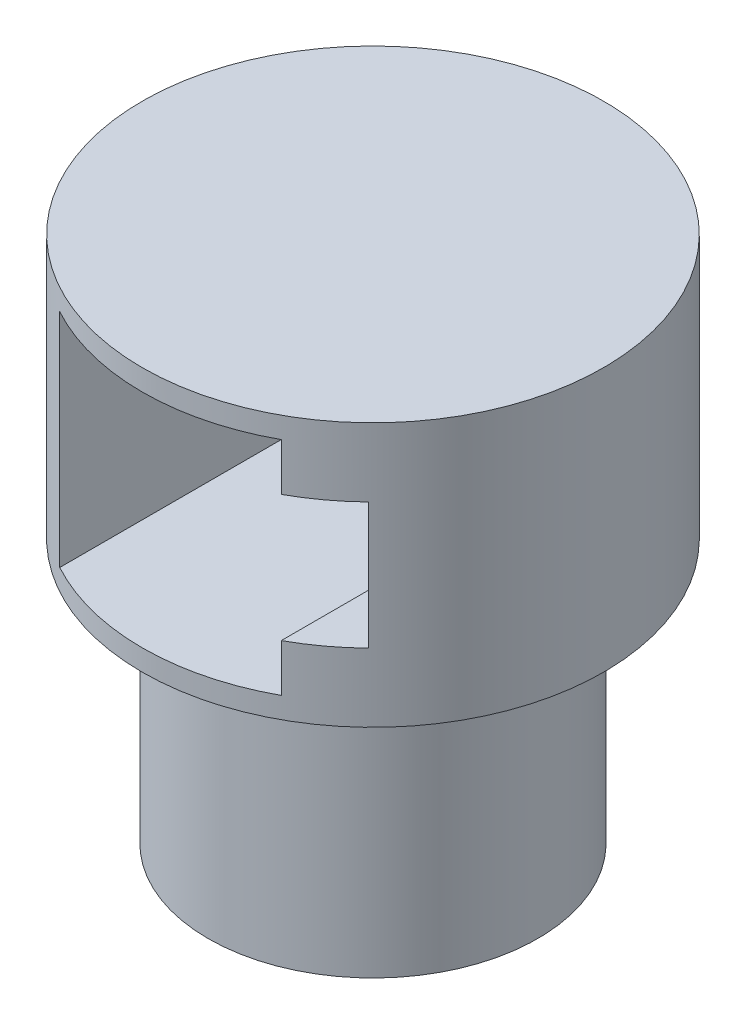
ISO-10303-21;
HEADER;
FILE_DESCRIPTION(('STEP AP214'),'2;1');
FILE_NAME('part.step','',(''),(''),'','','');
FILE_SCHEMA(('AUTOMOTIVE_DESIGN { 1 0 10303 214 1 1 1 1 }'));
ENDSEC;
DATA;
#1=APPLICATION_CONTEXT('core data for automotive mechanical design processes');
#2=APPLICATION_PROTOCOL_DEFINITION('international standard','automotive_design',2000,#1);
#3=PRODUCT_CONTEXT('',#1,'mechanical');
#4=PRODUCT('Part','Part','',(#3));
#5=PRODUCT_RELATED_PRODUCT_CATEGORY('part','',(#4));
#6=PRODUCT_DEFINITION_FORMATION('','',#4);
#7=PRODUCT_DEFINITION_CONTEXT('part definition',#1,'design');
#8=PRODUCT_DEFINITION('design','',#6,#7);
#9=PRODUCT_DEFINITION_SHAPE('','',#8);
#10=(LENGTH_UNIT() NAMED_UNIT(*) SI_UNIT(.MILLI.,.METRE.));
#11=(NAMED_UNIT(*) PLANE_ANGLE_UNIT() SI_UNIT($,.RADIAN.));
#12=(NAMED_UNIT(*) SI_UNIT($,.STERADIAN.) SOLID_ANGLE_UNIT());
#13=UNCERTAINTY_MEASURE_WITH_UNIT(LENGTH_MEASURE(1.E-05),#10,'distance_accuracy_value','');
#14=(GEOMETRIC_REPRESENTATION_CONTEXT(3) GLOBAL_UNCERTAINTY_ASSIGNED_CONTEXT((#13)) GLOBAL_UNIT_ASSIGNED_CONTEXT((#10,
#11,#12)) REPRESENTATION_CONTEXT('',''));
#15=CARTESIAN_POINT('',(0.,0.,0.));
#16=DIRECTION('',(0.,0.,1.));
#17=DIRECTION('',(1.,0.,0.));
#18=AXIS2_PLACEMENT_3D('',#15,#16,#17);
#19=CARTESIAN_POINT('',(0.,0.,0.));
#20=DIRECTION('',(0.,1.,0.));
#21=DIRECTION('',(0.,0.,1.));
#22=AXIS2_PLACEMENT_3D('',#19,#20,#21);
#23=PLANE('',#22);
#24=CARTESIAN_POINT('',(0.,0.,0.));
#25=DIRECTION('',(0.,1.,0.));
#26=DIRECTION('',(0.,0.,1.));
#27=AXIS2_PLACEMENT_3D('',#24,#25,#26);
#28=CIRCLE('',#27,31.75);
#29=CARTESIAN_POINT('',(0.,0.,31.75));
#30=VERTEX_POINT('',#29);
#31=EDGE_CURVE('E218',#30,#30,#28,.T.);
#32=ORIENTED_EDGE('',*,*,#31,.F.);
#33=EDGE_LOOP('',(#32));
#34=FACE_BOUND('',#33,.T.);
#35=CARTESIAN_POINT('',(0.,-1.20000000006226E-05,0.));
#36=DIRECTION('',(0.,-1.,0.));
#37=DIRECTION('',(0.699448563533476,0.,0.714682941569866));
#38=AXIS2_PLACEMENT_3D('',#35,#36,#37);
#39=CIRCLE('',#38,2.667);
#40=CARTESIAN_POINT('',(1.86543152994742,-1.2E-05,1.90606166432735));
#41=VERTEX_POINT('',#40);
#42=CARTESIAN_POINT('',(-1.8653831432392,-1.2E-05,1.90610202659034));
#43=VERTEX_POINT('',#42);
#44=EDGE_CURVE('E196',#41,#43,#39,.T.);
#45=ORIENTED_EDGE('',*,*,#44,.F.);
#46=CARTESIAN_POINT('',(0.,0.,0.));
#47=DIRECTION('',(0.,-1.,0.));
#48=DIRECTION('',(-0.699854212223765,0.,0.714285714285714));
#49=AXIS2_PLACEMENT_3D('',#46,#47,#48);
#50=CIRCLE('',#49,2.667);
#51=EDGE_CURVE('E206',#43,#41,#50,.T.);
#52=ORIENTED_EDGE('',*,*,#51,.F.);
#53=EDGE_LOOP('',(#45,#52));
#54=FACE_BOUND('',#53,.T.);
#55=ADVANCED_FACE('F50',(#34,#54),#23,.F.);
#56=CARTESIAN_POINT('',(0.,25.4,1.905));
#57=DIRECTION('',(0.,0.,-1.));
#58=DIRECTION('',(-1.,0.,0.));
#59=AXIS2_PLACEMENT_3D('',#56,#57,#58);
#60=PLANE('',#59);
#61=DIRECTION('',(0.,-1.,0.));
#62=VECTOR('',#61,1.);
#63=CARTESIAN_POINT('',(1.86651118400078,25.4,1.905));
#64=LINE('',#63,#62);
#65=CARTESIAN_POINT('',(1.86651118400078,25.4,1.905));
#66=VERTEX_POINT('',#65);
#67=CARTESIAN_POINT('',(1.86651118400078,5.588,1.905));
#68=VERTEX_POINT('',#67);
#69=EDGE_CURVE('E224',#66,#68,#64,.T.);
#70=ORIENTED_EDGE('',*,*,#69,.T.);
#71=DIRECTION('',(-1.,0.,0.));
#72=VECTOR('',#71,1.);
#73=CARTESIAN_POINT('',(0.,5.588,1.905));
#74=LINE('',#73,#72);
#75=CARTESIAN_POINT('',(-1.86651118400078,5.588,1.905));
#76=VERTEX_POINT('',#75);
#77=EDGE_CURVE('E198',#68,#76,#74,.T.);
#78=ORIENTED_EDGE('',*,*,#77,.T.);
#79=DIRECTION('',(0.,-1.,0.));
#80=VECTOR('',#79,1.);
#81=CARTESIAN_POINT('',(-1.86651118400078,25.4,1.905));
#82=LINE('',#81,#80);
#83=CARTESIAN_POINT('',(-1.86651118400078,25.4,1.905));
#84=VERTEX_POINT('',#83);
#85=EDGE_CURVE('E216',#84,#76,#82,.T.);
#86=ORIENTED_EDGE('',*,*,#85,.F.);
#87=DIRECTION('',(1.,0.,0.));
#88=VECTOR('',#87,1.);
#89=CARTESIAN_POINT('',(0.,25.4,1.905));
#90=LINE('',#89,#88);
#91=EDGE_CURVE('E215',#84,#66,#90,.T.);
#92=ORIENTED_EDGE('',*,*,#91,.T.);
#93=EDGE_LOOP('',(#70,#78,#86,#92));
#94=FACE_BOUND('',#93,.T.);
#95=ADVANCED_FACE('F252',(#94),#60,.T.);
#96=CARTESIAN_POINT('',(0.,101.6,0.));
#97=DIRECTION('',(0.,-1.,0.));
#98=DIRECTION('',(0.,0.,-1.));
#99=AXIS2_PLACEMENT_3D('',#96,#97,#98);
#100=CYLINDRICAL_SURFACE('',#99,31.75);
#101=ORIENTED_EDGE('',*,*,#31,.T.);
#102=EDGE_LOOP('',(#101));
#103=FACE_BOUND('',#102,.T.);
#104=CARTESIAN_POINT('',(0.,50.8,0.));
#105=DIRECTION('',(0.,1.,0.));
#106=DIRECTION('',(0.,0.,1.));
#107=AXIS2_PLACEMENT_3D('',#104,#105,#106);
#108=CIRCLE('',#107,31.75);
#109=CARTESIAN_POINT('',(0.,50.8,31.75));
#110=VERTEX_POINT('',#109);
#111=EDGE_CURVE('E222',#110,#110,#108,.T.);
#112=ORIENTED_EDGE('',*,*,#111,.F.);
#113=EDGE_LOOP('',(#112));
#114=FACE_BOUND('',#113,.T.);
#115=ADVANCED_FACE('F47',(#103,#114),#100,.T.);
#116=CARTESIAN_POINT('',(0.,25.4,0.));
#117=DIRECTION('',(0.,-1.,0.));
#118=DIRECTION('',(0.,0.,-1.));
#119=AXIS2_PLACEMENT_3D('',#116,#117,#118);
#120=CYLINDRICAL_SURFACE('',#119,2.667);
#121=ORIENTED_EDGE('',*,*,#51,.T.);
#122=ORIENTED_EDGE('',*,*,#44,.T.);
#123=EDGE_LOOP('',(#121,#122));
#124=FACE_BOUND('',#123,.T.);
#125=ORIENTED_EDGE('',*,*,#85,.T.);
#126=CARTESIAN_POINT('',(0.,5.588,0.));
#127=DIRECTION('',(0.,-1.,0.));
#128=DIRECTION('',(0.,0.,-1.));
#129=AXIS2_PLACEMENT_3D('',#126,#127,#128);
#130=CIRCLE('',#129,2.667);
#131=EDGE_CURVE('E68',#68,#76,#130,.T.);
#132=ORIENTED_EDGE('',*,*,#131,.F.);
#133=ORIENTED_EDGE('',*,*,#69,.F.);
#134=CARTESIAN_POINT('',(0.,25.4,0.));
#135=DIRECTION('',(0.,-1.,0.));
#136=DIRECTION('',(0.,0.,-1.));
#137=AXIS2_PLACEMENT_3D('',#134,#135,#136);
#138=CIRCLE('',#137,2.667);
#139=EDGE_CURVE('E213',#84,#66,#138,.T.);
#140=ORIENTED_EDGE('',*,*,#139,.F.);
#141=EDGE_LOOP('',(#125,#132,#133,#140));
#142=FACE_BOUND('',#141,.T.);
#143=ADVANCED_FACE('F237',(#124,#142),#120,.F.);
#144=CARTESIAN_POINT('',(0.,25.4,0.));
#145=DIRECTION('',(0.,-1.,0.));
#146=DIRECTION('',(0.,0.,-1.));
#147=AXIS2_PLACEMENT_3D('',#144,#145,#146);
#148=PLANE('',#147);
#149=ORIENTED_EDGE('',*,*,#91,.F.);
#150=ORIENTED_EDGE('',*,*,#139,.T.);
#151=EDGE_LOOP('',(#149,#150));
#152=FACE_BOUND('',#151,.T.);
#153=ADVANCED_FACE('F248',(#152),#148,.T.);
#154=CARTESIAN_POINT('',(0.,50.8,0.));
#155=DIRECTION('',(0.,1.,0.));
#156=DIRECTION('',(0.,0.,1.));
#157=AXIS2_PLACEMENT_3D('',#154,#155,#156);
#158=CYLINDRICAL_SURFACE('',#157,44.45);
#159=CARTESIAN_POINT('',(0.,54.864,0.));
#160=DIRECTION('',(0.,-1.,0.));
#161=DIRECTION('',(0.,0.,-1.));
#162=AXIS2_PLACEMENT_3D('',#159,#160,#161);
#163=CIRCLE('',#162,44.45);
#164=CARTESIAN_POINT('',(-21.336,54.864,38.9945842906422));
#165=VERTEX_POINT('',#164);
#166=CARTESIAN_POINT('',(21.336,54.864,38.9945842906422));
#167=VERTEX_POINT('',#166);
#168=EDGE_CURVE('E131',#165,#167,#163,.F.);
#169=ORIENTED_EDGE('',*,*,#168,.F.);
#170=DIRECTION('',(0.,1.,0.));
#171=VECTOR('',#170,1.);
#172=CARTESIAN_POINT('',(-21.336,50.8,38.9945842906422));
#173=LINE('',#172,#171);
#174=CARTESIAN_POINT('',(-21.336,97.536,38.9945842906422));
#175=VERTEX_POINT('',#174);
#176=EDGE_CURVE('E12',#165,#175,#173,.T.);
#177=ORIENTED_EDGE('',*,*,#176,.T.);
#178=CARTESIAN_POINT('',(0.,97.536,0.));
#179=DIRECTION('',(0.,-1.,0.));
#180=DIRECTION('',(0.,0.,-1.));
#181=AXIS2_PLACEMENT_3D('',#178,#179,#180);
#182=CIRCLE('',#181,44.45);
#183=CARTESIAN_POINT('',(21.336,97.536,38.9945842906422));
#184=VERTEX_POINT('',#183);
#185=EDGE_CURVE('E230',#175,#184,#182,.F.);
#186=ORIENTED_EDGE('',*,*,#185,.T.);
#187=DIRECTION('',(0.,1.,0.));
#188=VECTOR('',#187,1.);
#189=CARTESIAN_POINT('',(21.336,50.8,38.9945842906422));
#190=LINE('',#189,#188);
#191=CARTESIAN_POINT('',(21.336,88.392,38.9945842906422));
#192=VERTEX_POINT('',#191);
#193=EDGE_CURVE('E57',#192,#184,#190,.T.);
#194=ORIENTED_EDGE('',*,*,#193,.F.);
#195=CARTESIAN_POINT('',(0.,88.392,0.));
#196=DIRECTION('',(0.,1.,0.));
#197=DIRECTION('',(0.,0.,1.));
#198=AXIS2_PLACEMENT_3D('',#195,#196,#197);
#199=CIRCLE('',#198,44.45);
#200=CARTESIAN_POINT('',(30.988,88.392,31.8676380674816));
#201=VERTEX_POINT('',#200);
#202=EDGE_CURVE('E278',#201,#192,#199,.F.);
#203=ORIENTED_EDGE('',*,*,#202,.F.);
#204=DIRECTION('',(0.,1.,0.));
#205=VECTOR('',#204,1.);
#206=CARTESIAN_POINT('',(30.988,50.8,31.8676380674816));
#207=LINE('',#206,#205);
#208=CARTESIAN_POINT('',(30.988,64.008,31.8676380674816));
#209=VERTEX_POINT('',#208);
#210=EDGE_CURVE('E280',#209,#201,#207,.T.);
#211=ORIENTED_EDGE('',*,*,#210,.F.);
#212=CARTESIAN_POINT('',(0.,64.008,0.));
#213=DIRECTION('',(0.,1.,0.));
#214=DIRECTION('',(0.,0.,1.));
#215=AXIS2_PLACEMENT_3D('',#212,#213,#214);
#216=CIRCLE('',#215,44.45);
#217=CARTESIAN_POINT('',(21.336,64.008,38.9945842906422));
#218=VERTEX_POINT('',#217);
#219=EDGE_CURVE('E271',#209,#218,#216,.F.);
#220=ORIENTED_EDGE('',*,*,#219,.T.);
#221=DIRECTION('',(0.,1.,0.));
#222=VECTOR('',#221,1.);
#223=CARTESIAN_POINT('',(21.336,50.8,38.9945842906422));
#224=LINE('',#223,#222);
#225=EDGE_CURVE('E269',#167,#218,#224,.T.);
#226=ORIENTED_EDGE('',*,*,#225,.F.);
#227=EDGE_LOOP('',(#169,#177,#186,#194,#203,#211,#220,#226));
#228=FACE_BOUND('',#227,.T.);
#229=CARTESIAN_POINT('',(0.,50.8,0.));
#230=DIRECTION('',(0.,1.,0.));
#231=DIRECTION('',(0.,0.,1.));
#232=AXIS2_PLACEMENT_3D('',#229,#230,#231);
#233=CIRCLE('',#232,44.45);
#234=CARTESIAN_POINT('',(0.,50.8,44.45));
#235=VERTEX_POINT('',#234);
#236=EDGE_CURVE('E202',#235,#235,#233,.T.);
#237=ORIENTED_EDGE('',*,*,#236,.T.);
#238=EDGE_LOOP('',(#237));
#239=FACE_BOUND('',#238,.T.);
#240=CARTESIAN_POINT('',(0.,101.6,0.));
#241=DIRECTION('',(0.,1.,0.));
#242=DIRECTION('',(0.,0.,1.));
#243=AXIS2_PLACEMENT_3D('',#240,#241,#242);
#244=CIRCLE('',#243,44.45);
#245=CARTESIAN_POINT('',(0.,101.6,44.45));
#246=VERTEX_POINT('',#245);
#247=EDGE_CURVE('E203',#246,#246,#244,.T.);
#248=ORIENTED_EDGE('',*,*,#247,.F.);
#249=EDGE_LOOP('',(#248));
#250=FACE_BOUND('',#249,.T.);
#251=ADVANCED_FACE('F295',(#228,#239,#250),#158,.T.);
#252=CARTESIAN_POINT('',(0.,50.8,0.));
#253=DIRECTION('',(0.,1.,0.));
#254=DIRECTION('',(0.,0.,1.));
#255=AXIS2_PLACEMENT_3D('',#252,#253,#254);
#256=PLANE('',#255);
#257=ORIENTED_EDGE('',*,*,#111,.T.);
#258=EDGE_LOOP('',(#257));
#259=FACE_BOUND('',#258,.T.);
#260=ORIENTED_EDGE('',*,*,#236,.F.);
#261=EDGE_LOOP('',(#260));
#262=FACE_BOUND('',#261,.T.);
#263=ADVANCED_FACE('F336',(#259,#262),#256,.F.);
#264=CARTESIAN_POINT('',(0.,101.6,0.));
#265=DIRECTION('',(0.,1.,0.));
#266=DIRECTION('',(0.,0.,1.));
#267=AXIS2_PLACEMENT_3D('',#264,#265,#266);
#268=PLANE('',#267);
#269=ORIENTED_EDGE('',*,*,#247,.T.);
#270=EDGE_LOOP('',(#269));
#271=FACE_BOUND('',#270,.T.);
#272=ADVANCED_FACE('F330',(#271),#268,.T.);
#273=CARTESIAN_POINT('',(0.,5.588,0.));
#274=DIRECTION('',(0.,-1.,0.));
#275=DIRECTION('',(0.,0.,-1.));
#276=AXIS2_PLACEMENT_3D('',#273,#274,#275);
#277=PLANE('',#276);
#278=ORIENTED_EDGE('',*,*,#131,.T.);
#279=ORIENTED_EDGE('',*,*,#77,.F.);
#280=EDGE_LOOP('',(#278,#279));
#281=FACE_BOUND('',#280,.T.);
#282=ADVANCED_FACE('F340',(#281),#277,.T.);
#283=CARTESIAN_POINT('',(0.,54.864,-6.35));
#284=DIRECTION('',(0.,-1.,0.));
#285=DIRECTION('',(0.,0.,-1.));
#286=AXIS2_PLACEMENT_3D('',#283,#284,#285);
#287=PLANE('',#286);
#288=DIRECTION('',(0.,0.,1.));
#289=VECTOR('',#288,1.);
#290=CARTESIAN_POINT('',(-21.336,54.864,-6.35));
#291=LINE('',#290,#289);
#292=CARTESIAN_POINT('',(-21.336,54.864,-6.35));
#293=VERTEX_POINT('',#292);
#294=EDGE_CURVE('E175',#293,#165,#291,.T.);
#295=ORIENTED_EDGE('',*,*,#294,.T.);
#296=ORIENTED_EDGE('',*,*,#168,.T.);
#297=DIRECTION('',(0.,0.,1.));
#298=VECTOR('',#297,1.);
#299=CARTESIAN_POINT('',(21.336,54.864,-6.35));
#300=LINE('',#299,#298);
#301=CARTESIAN_POINT('',(21.336,54.864,-6.35));
#302=VERTEX_POINT('',#301);
#303=EDGE_CURVE('E64',#302,#167,#300,.T.);
#304=ORIENTED_EDGE('',*,*,#303,.F.);
#305=DIRECTION('',(1.,0.,0.));
#306=VECTOR('',#305,1.);
#307=CARTESIAN_POINT('',(0.,54.864,-6.35));
#308=LINE('',#307,#306);
#309=EDGE_CURVE('E134',#293,#302,#308,.T.);
#310=ORIENTED_EDGE('',*,*,#309,.F.);
#311=EDGE_LOOP('',(#295,#296,#304,#310));
#312=FACE_BOUND('',#311,.T.);
#313=ADVANCED_FACE('F132',(#312),#287,.F.);
#314=CARTESIAN_POINT('',(-21.336,0.,-6.35));
#315=DIRECTION('',(1.,0.,0.));
#316=DIRECTION('',(0.,0.,-1.));
#317=AXIS2_PLACEMENT_3D('',#314,#315,#316);
#318=PLANE('',#317);
#319=ORIENTED_EDGE('',*,*,#294,.F.);
#320=DIRECTION('',(0.,1.,0.));
#321=VECTOR('',#320,1.);
#322=CARTESIAN_POINT('',(-21.336,0.,-6.35));
#323=LINE('',#322,#321);
#324=CARTESIAN_POINT('',(-21.336,97.536,-6.35));
#325=VERTEX_POINT('',#324);
#326=EDGE_CURVE('E138',#293,#325,#323,.T.);
#327=ORIENTED_EDGE('',*,*,#326,.T.);
#328=DIRECTION('',(0.,0.,1.));
#329=VECTOR('',#328,1.);
#330=CARTESIAN_POINT('',(-21.336,97.536,-6.35));
#331=LINE('',#330,#329);
#332=EDGE_CURVE('E174',#325,#175,#331,.T.);
#333=ORIENTED_EDGE('',*,*,#332,.T.);
#334=ORIENTED_EDGE('',*,*,#176,.F.);
#335=EDGE_LOOP('',(#319,#327,#333,#334));
#336=FACE_BOUND('',#335,.T.);
#337=ADVANCED_FACE('F296',(#336),#318,.T.);
#338=CARTESIAN_POINT('',(0.,97.536,-6.35));
#339=DIRECTION('',(0.,-1.,0.));
#340=DIRECTION('',(0.,0.,-1.));
#341=AXIS2_PLACEMENT_3D('',#338,#339,#340);
#342=PLANE('',#341);
#343=ORIENTED_EDGE('',*,*,#332,.F.);
#344=DIRECTION('',(1.,0.,0.));
#345=VECTOR('',#344,1.);
#346=CARTESIAN_POINT('',(0.,97.536,-6.35));
#347=LINE('',#346,#345);
#348=CARTESIAN_POINT('',(21.336,97.536,-6.35));
#349=VERTEX_POINT('',#348);
#350=EDGE_CURVE('E170',#325,#349,#347,.T.);
#351=ORIENTED_EDGE('',*,*,#350,.T.);
#352=DIRECTION('',(0.,0.,1.));
#353=VECTOR('',#352,1.);
#354=CARTESIAN_POINT('',(21.336,97.536,-6.35));
#355=LINE('',#354,#353);
#356=EDGE_CURVE('E177',#349,#184,#355,.T.);
#357=ORIENTED_EDGE('',*,*,#356,.T.);
#358=ORIENTED_EDGE('',*,*,#185,.F.);
#359=EDGE_LOOP('',(#343,#351,#357,#358));
#360=FACE_BOUND('',#359,.T.);
#361=ADVANCED_FACE('F291',(#360),#342,.T.);
#362=CARTESIAN_POINT('',(21.336,0.,-6.35));
#363=DIRECTION('',(1.,0.,0.));
#364=DIRECTION('',(0.,0.,-1.));
#365=AXIS2_PLACEMENT_3D('',#362,#363,#364);
#366=PLANE('',#365);
#367=ORIENTED_EDGE('',*,*,#193,.T.);
#368=ORIENTED_EDGE('',*,*,#356,.F.);
#369=DIRECTION('',(0.,1.,0.));
#370=VECTOR('',#369,1.);
#371=CARTESIAN_POINT('',(21.336,0.,-6.35));
#372=LINE('',#371,#370);
#373=CARTESIAN_POINT('',(21.336,88.392,-6.35));
#374=VERTEX_POINT('',#373);
#375=EDGE_CURVE('E148',#374,#349,#372,.T.);
#376=ORIENTED_EDGE('',*,*,#375,.F.);
#377=DIRECTION('',(0.,0.,1.));
#378=VECTOR('',#377,1.);
#379=CARTESIAN_POINT('',(21.336,88.392,-6.35));
#380=LINE('',#379,#378);
#381=EDGE_CURVE('E182',#374,#192,#380,.T.);
#382=ORIENTED_EDGE('',*,*,#381,.T.);
#383=EDGE_LOOP('',(#367,#368,#376,#382));
#384=FACE_BOUND('',#383,.T.);
#385=ADVANCED_FACE('F286',(#384),#366,.F.);
#386=CARTESIAN_POINT('',(0.,88.392,-6.35));
#387=DIRECTION('',(0.,1.,0.));
#388=DIRECTION('',(0.,0.,1.));
#389=AXIS2_PLACEMENT_3D('',#386,#387,#388);
#390=PLANE('',#389);
#391=ORIENTED_EDGE('',*,*,#202,.T.);
#392=ORIENTED_EDGE('',*,*,#381,.F.);
#393=DIRECTION('',(-1.,0.,0.));
#394=VECTOR('',#393,1.);
#395=CARTESIAN_POINT('',(0.,88.392,-6.35));
#396=LINE('',#395,#394);
#397=CARTESIAN_POINT('',(30.988,88.392,-6.35));
#398=VERTEX_POINT('',#397);
#399=EDGE_CURVE('E161',#398,#374,#396,.T.);
#400=ORIENTED_EDGE('',*,*,#399,.F.);
#401=DIRECTION('',(0.,0.,1.));
#402=VECTOR('',#401,1.);
#403=CARTESIAN_POINT('',(30.988,88.392,-6.35));
#404=LINE('',#403,#402);
#405=EDGE_CURVE('E190',#398,#201,#404,.T.);
#406=ORIENTED_EDGE('',*,*,#405,.T.);
#407=EDGE_LOOP('',(#391,#392,#400,#406));
#408=FACE_BOUND('',#407,.T.);
#409=ADVANCED_FACE('F364',(#408),#390,.F.);
#410=CARTESIAN_POINT('',(30.988,0.,-6.35));
#411=DIRECTION('',(1.,0.,0.));
#412=DIRECTION('',(0.,0.,-1.));
#413=AXIS2_PLACEMENT_3D('',#410,#411,#412);
#414=PLANE('',#413);
#415=ORIENTED_EDGE('',*,*,#210,.T.);
#416=ORIENTED_EDGE('',*,*,#405,.F.);
#417=DIRECTION('',(0.,1.,0.));
#418=VECTOR('',#417,1.);
#419=CARTESIAN_POINT('',(30.988,0.,-6.35));
#420=LINE('',#419,#418);
#421=CARTESIAN_POINT('',(30.988,64.008,-6.35));
#422=VERTEX_POINT('',#421);
#423=EDGE_CURVE('E157',#422,#398,#420,.T.);
#424=ORIENTED_EDGE('',*,*,#423,.F.);
#425=DIRECTION('',(0.,0.,1.));
#426=VECTOR('',#425,1.);
#427=CARTESIAN_POINT('',(30.988,64.008,-6.35));
#428=LINE('',#427,#426);
#429=EDGE_CURVE('E192',#422,#209,#428,.T.);
#430=ORIENTED_EDGE('',*,*,#429,.T.);
#431=EDGE_LOOP('',(#415,#416,#424,#430));
#432=FACE_BOUND('',#431,.T.);
#433=ADVANCED_FACE('F359',(#432),#414,.F.);
#434=CARTESIAN_POINT('',(0.,64.008,-6.35));
#435=DIRECTION('',(0.,1.,0.));
#436=DIRECTION('',(0.,0.,1.));
#437=AXIS2_PLACEMENT_3D('',#434,#435,#436);
#438=PLANE('',#437);
#439=ORIENTED_EDGE('',*,*,#429,.F.);
#440=DIRECTION('',(-1.,0.,0.));
#441=VECTOR('',#440,1.);
#442=CARTESIAN_POINT('',(0.,64.008,-6.35));
#443=LINE('',#442,#441);
#444=CARTESIAN_POINT('',(21.336,64.008,-6.35));
#445=VERTEX_POINT('',#444);
#446=EDGE_CURVE('E149',#422,#445,#443,.T.);
#447=ORIENTED_EDGE('',*,*,#446,.T.);
#448=DIRECTION('',(0.,0.,1.));
#449=VECTOR('',#448,1.);
#450=CARTESIAN_POINT('',(21.336,64.008,-6.35));
#451=LINE('',#450,#449);
#452=EDGE_CURVE('E140',#445,#218,#451,.T.);
#453=ORIENTED_EDGE('',*,*,#452,.T.);
#454=ORIENTED_EDGE('',*,*,#219,.F.);
#455=EDGE_LOOP('',(#439,#447,#453,#454));
#456=FACE_BOUND('',#455,.T.);
#457=ADVANCED_FACE('F357',(#456),#438,.T.);
#458=ORIENTED_EDGE('',*,*,#225,.T.);
#459=ORIENTED_EDGE('',*,*,#452,.F.);
#460=EDGE_CURVE('E145',#302,#445,#372,.T.);
#461=ORIENTED_EDGE('',*,*,#460,.F.);
#462=ORIENTED_EDGE('',*,*,#303,.T.);
#463=EDGE_LOOP('',(#458,#459,#461,#462));
#464=FACE_BOUND('',#463,.T.);
#465=ADVANCED_FACE('F141',(#464),#366,.F.);
#466=CARTESIAN_POINT('',(0.,0.,-6.35));
#467=DIRECTION('',(0.,0.,1.));
#468=DIRECTION('',(1.,0.,0.));
#469=AXIS2_PLACEMENT_3D('',#466,#467,#468);
#470=PLANE('',#469);
#471=ORIENTED_EDGE('',*,*,#309,.T.);
#472=ORIENTED_EDGE('',*,*,#460,.T.);
#473=ORIENTED_EDGE('',*,*,#446,.F.);
#474=ORIENTED_EDGE('',*,*,#423,.T.);
#475=ORIENTED_EDGE('',*,*,#399,.T.);
#476=ORIENTED_EDGE('',*,*,#375,.T.);
#477=ORIENTED_EDGE('',*,*,#350,.F.);
#478=ORIENTED_EDGE('',*,*,#326,.F.);
#479=EDGE_LOOP('',(#471,#472,#473,#474,#475,#476,#477,#478));
#480=FACE_BOUND('',#479,.T.);
#481=ADVANCED_FACE('F155',(#480),#470,.T.);
#482=CLOSED_SHELL('',(#55,#95,#115,#143,#153,#251,#263,#272,#282,#313,#337,#361,#385,#409,#433,
#457,#465,#481));
#483=MANIFOLD_SOLID_BREP('B2',#482);
#484=ADVANCED_BREP_SHAPE_REPRESENTATION('',(#18,#483),#14);
#485=SHAPE_DEFINITION_REPRESENTATION(#9,#484);
ENDSEC;
END-ISO-10303-21;
